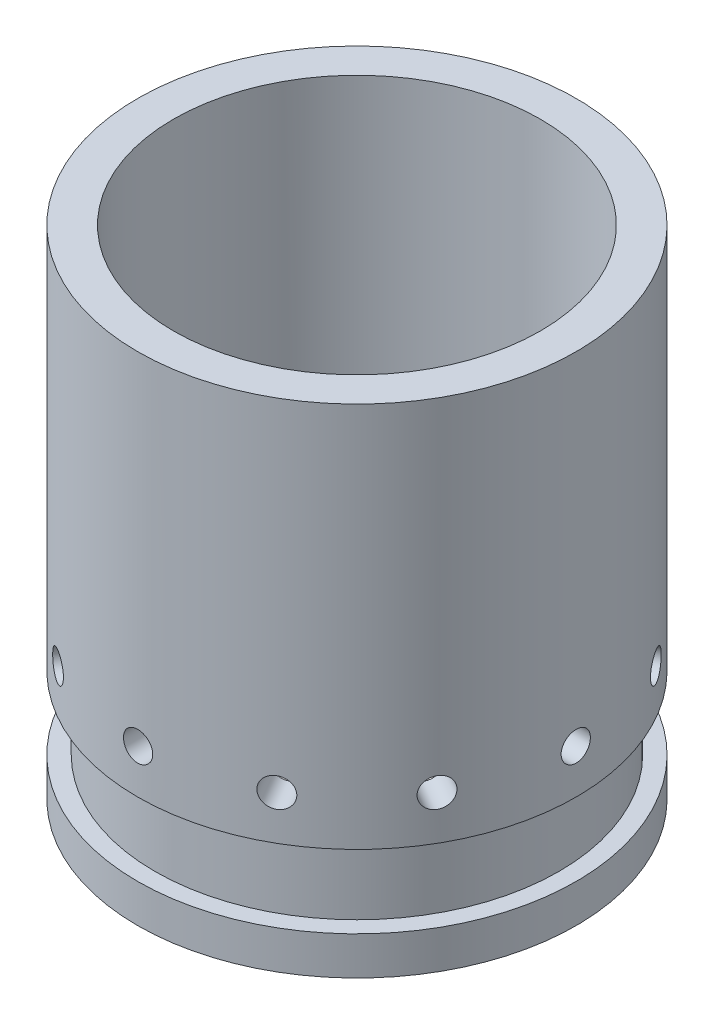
from build123d import *

# Parameters (mm, degrees)
SKETCH1_R                 = 19.05
SKETCH1_R_2               = 15.9385
MAINBODY_DEPTH            = 43.18
SKETCH2_R                 = 1.27
RELEASEHOLE_DEPTH         = 43.18
RELEASEHOLESPATTERN_COUNT = 12
SKETCH3_W                 = 1.5
SKETCH3_H                 = 6.35


with BuildPart() as part:
    # Sketch1 → MainBody (new body)
    with BuildSketch(Plane(origin=(0, 0, 0), x_dir=(1, 0, 0), z_dir=(0, 1, 0))):
        with Locations(Location((0, 0, 0), (0, 0, 270))):
            Circle(SKETCH1_R)
        with Locations(Location((0, 0, 0), (0, 0, 270))):
            Circle(SKETCH1_R_2, mode=Mode.SUBTRACT)
    extrude(amount=MAINBODY_DEPTH)

    # Sketch2 → ReleaseHole (cut)
    with BuildSketch(Plane.XY):
        with Locations(Location((0, 13.5, 0), (0, 0, 90))):
            Circle(SKETCH2_R)
    releasehole = extrude(amount=-RELEASEHOLE_DEPTH, mode=Mode.SUBTRACT)

    # ReleaseHolesPattern: ReleaseHole ×12 about axis
    releaseholespattern_axis = Axis((0, 43.18, 0), (0, -1, 0))
    for i in range(1, RELEASEHOLESPATTERN_COUNT):
        add(releasehole.rotate(releaseholespattern_axis, i * 360 / RELEASEHOLESPATTERN_COUNT), mode=Mode.SUBTRACT)

    # Sketch3 → Cut-Revolve1 (revolve, cut)
    with BuildSketch(Plane.XY, mode=Mode.PRIVATE) as cut_revolve1_sk:
        with Locations((18.3, 6.5)):
            Rectangle(SKETCH3_W, SKETCH3_H)
    revolve(cut_revolve1_sk.sketch.rotate(Axis((0, 43.18, 0), (0, -1, 0)), 90), axis=Axis((0, 43.18, 0), (0, -1, 0)), mode=Mode.SUBTRACT)


solid = part.part
